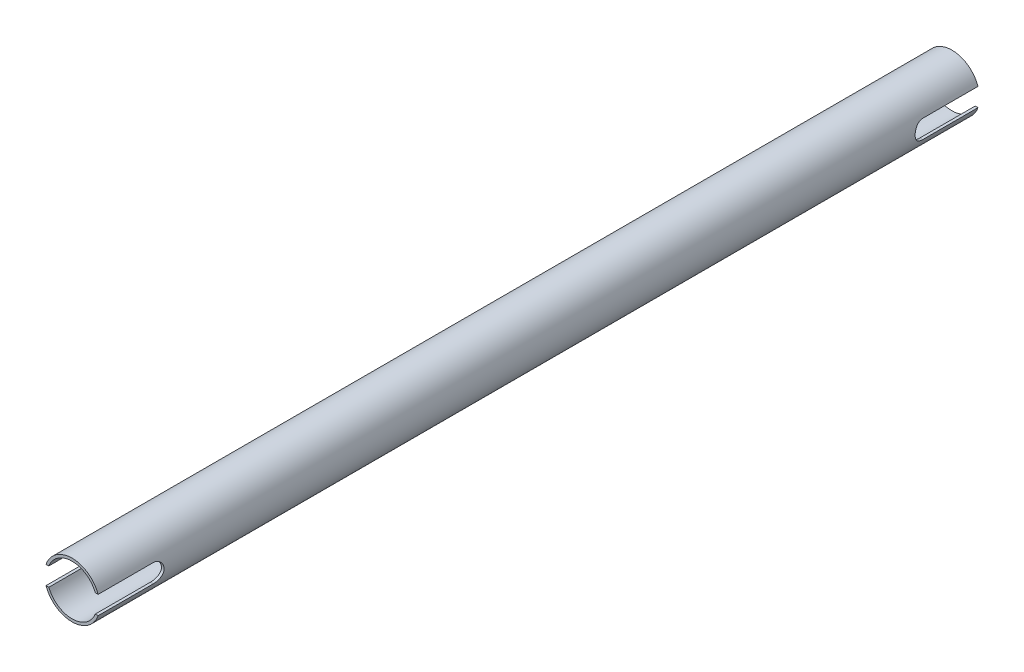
from build123d import *

# Parameters (mm, degrees)
SKETCH1_R           = 9.525
SKETCH1_R_2         = 8.61314
EXTRUDE_THIN1_DEPTH = 151.69444769
CUT_EXTRUDE1_DEPTH  = 153.291354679


with BuildPart() as part:
    # Sketch1 → Extrude-Thin1 (new, symmetric)
    with BuildSketch(Plane.XY):
        Circle(SKETCH1_R)
        Circle(SKETCH1_R_2, mode=Mode.SUBTRACT)
    extrude(amount=EXTRUDE_THIN1_DEPTH, both=True)

    # Sketch2 → Cut-Extrude1 (cut, symmetric)
    with BuildSketch(Plane(origin=(0, 0, 0), x_dir=(0, 0, -1), z_dir=(1, 0, 0))):
        with BuildLine():
            Line((151.69444769, 3.175), (151.69444769, -3.175))
            Line((151.69444769, -3.175), (132.64444769, -3.175))
            ThreePointArc((132.64444769, -3.175), (129.46944769, 0), (132.64444769, 3.175))
            Line((132.64444769, 3.175), (151.69444769, 3.175))
        make_face()
    cut_extrude1 = extrude(amount=CUT_EXTRUDE1_DEPTH, both=True, mode=Mode.SUBTRACT)

    # Mirror1: Cut-Extrude1 across plane
    add(cut_extrude1.mirror(Plane.XY), mode=Mode.SUBTRACT)


solid = part.part
